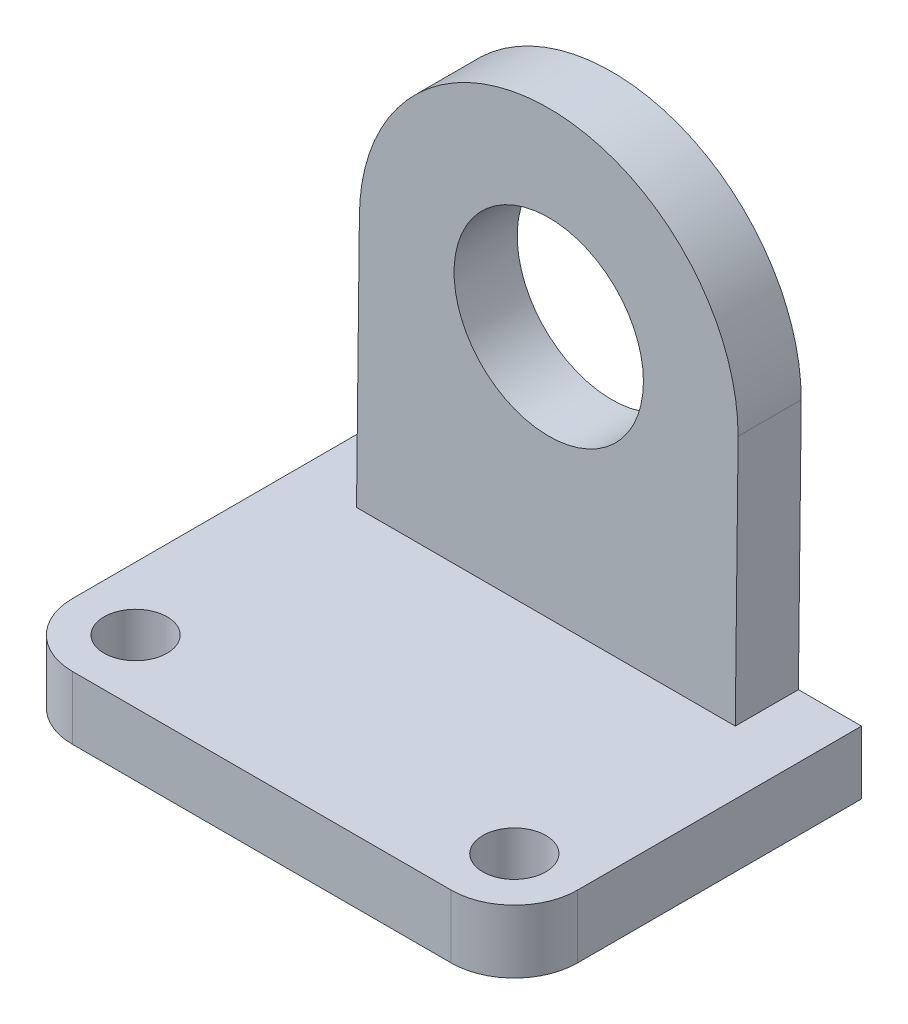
ISO-10303-21;
HEADER;
FILE_DESCRIPTION(('STEP AP214'),'2;1');
FILE_NAME('part.step','',(''),(''),'','','');
FILE_SCHEMA(('AUTOMOTIVE_DESIGN { 1 0 10303 214 1 1 1 1 }'));
ENDSEC;
DATA;
#1=APPLICATION_CONTEXT('core data for automotive mechanical design processes');
#2=APPLICATION_PROTOCOL_DEFINITION('international standard','automotive_design',2000,#1);
#3=PRODUCT_CONTEXT('',#1,'mechanical');
#4=PRODUCT('Part','Part','',(#3));
#5=PRODUCT_RELATED_PRODUCT_CATEGORY('part','',(#4));
#6=PRODUCT_DEFINITION_FORMATION('','',#4);
#7=PRODUCT_DEFINITION_CONTEXT('part definition',#1,'design');
#8=PRODUCT_DEFINITION('design','',#6,#7);
#9=PRODUCT_DEFINITION_SHAPE('','',#8);
#10=(LENGTH_UNIT() NAMED_UNIT(*) SI_UNIT(.MILLI.,.METRE.));
#11=(NAMED_UNIT(*) PLANE_ANGLE_UNIT() SI_UNIT($,.RADIAN.));
#12=(NAMED_UNIT(*) SI_UNIT($,.STERADIAN.) SOLID_ANGLE_UNIT());
#13=UNCERTAINTY_MEASURE_WITH_UNIT(LENGTH_MEASURE(1.E-05),#10,'distance_accuracy_value','');
#14=(GEOMETRIC_REPRESENTATION_CONTEXT(3) GLOBAL_UNCERTAINTY_ASSIGNED_CONTEXT((#13)) GLOBAL_UNIT_ASSIGNED_CONTEXT((#10,
#11,#12)) REPRESENTATION_CONTEXT('',''));
#15=CARTESIAN_POINT('',(0.,0.,0.));
#16=DIRECTION('',(0.,0.,1.));
#17=DIRECTION('',(1.,0.,0.));
#18=AXIS2_PLACEMENT_3D('',#15,#16,#17);
#19=CARTESIAN_POINT('',(-30.,10.,45.));
#20=DIRECTION('',(0.,-1.,0.));
#21=DIRECTION('',(0.,0.,-1.));
#22=AXIS2_PLACEMENT_3D('',#19,#20,#21);
#23=PLANE('',#22);
#24=CARTESIAN_POINT('',(30.,10.,45.));
#25=DIRECTION('',(0.,1.,0.));
#26=DIRECTION('',(0.,0.,-1.));
#27=AXIS2_PLACEMENT_3D('',#24,#25,#26);
#28=CIRCLE('',#27,5.);
#29=CARTESIAN_POINT('',(30.,10.,40.));
#30=VERTEX_POINT('',#29);
#31=EDGE_CURVE('E164',#30,#30,#28,.T.);
#32=ORIENTED_EDGE('',*,*,#31,.F.);
#33=EDGE_LOOP('',(#32));
#34=FACE_BOUND('',#33,.T.);
#35=CARTESIAN_POINT('',(-30.,10.,45.));
#36=DIRECTION('',(0.,1.,0.));
#37=DIRECTION('',(0.,0.,1.));
#38=AXIS2_PLACEMENT_3D('',#35,#36,#37);
#39=CIRCLE('',#38,5.);
#40=CARTESIAN_POINT('',(-30.,10.,50.));
#41=VERTEX_POINT('',#40);
#42=EDGE_CURVE('E154',#41,#41,#39,.T.);
#43=ORIENTED_EDGE('',*,*,#42,.F.);
#44=EDGE_LOOP('',(#43));
#45=FACE_BOUND('',#44,.T.);
#46=DIRECTION('',(0.,0.,-1.));
#47=VECTOR('',#46,1.);
#48=CARTESIAN_POINT('',(29.9999999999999,10.,10.));
#49=LINE('',#48,#47);
#50=CARTESIAN_POINT('',(29.9999999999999,10.,10.));
#51=VERTEX_POINT('',#50);
#52=CARTESIAN_POINT('',(29.9999999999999,10.,0.));
#53=VERTEX_POINT('',#52);
#54=EDGE_CURVE('E189',#51,#53,#49,.T.);
#55=ORIENTED_EDGE('',*,*,#54,.F.);
#56=DIRECTION('',(1.,0.,0.));
#57=VECTOR('',#56,1.);
#58=CARTESIAN_POINT('',(-29.9999999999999,10.,10.));
#59=LINE('',#58,#57);
#60=CARTESIAN_POINT('',(-29.9999999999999,10.,10.));
#61=VERTEX_POINT('',#60);
#62=EDGE_CURVE('E212',#61,#51,#59,.T.);
#63=ORIENTED_EDGE('',*,*,#62,.F.);
#64=DIRECTION('',(0.,0.,-1.));
#65=VECTOR('',#64,1.);
#66=CARTESIAN_POINT('',(-29.9999999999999,10.,10.));
#67=LINE('',#66,#65);
#68=CARTESIAN_POINT('',(-29.9999999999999,10.,0.));
#69=VERTEX_POINT('',#68);
#70=EDGE_CURVE('E210',#61,#69,#67,.T.);
#71=ORIENTED_EDGE('',*,*,#70,.T.);
#72=DIRECTION('',(-1.,0.,0.));
#73=VECTOR('',#72,1.);
#74=CARTESIAN_POINT('',(40.,10.,0.));
#75=LINE('',#74,#73);
#76=CARTESIAN_POINT('',(-40.,10.,0.));
#77=VERTEX_POINT('',#76);
#78=EDGE_CURVE('E56',#69,#77,#75,.T.);
#79=ORIENTED_EDGE('',*,*,#78,.T.);
#80=DIRECTION('',(0.,0.,1.));
#81=VECTOR('',#80,1.);
#82=CARTESIAN_POINT('',(-40.,10.,0.));
#83=LINE('',#82,#81);
#84=CARTESIAN_POINT('',(-40.,10.,45.));
#85=VERTEX_POINT('',#84);
#86=EDGE_CURVE('E147',#77,#85,#83,.T.);
#87=ORIENTED_EDGE('',*,*,#86,.T.);
#88=CARTESIAN_POINT('',(-30.,10.,45.));
#89=DIRECTION('',(0.,1.,0.));
#90=DIRECTION('',(0.,0.,-1.));
#91=AXIS2_PLACEMENT_3D('',#88,#89,#90);
#92=CIRCLE('',#91,10.);
#93=CARTESIAN_POINT('',(-30.,10.,55.));
#94=VERTEX_POINT('',#93);
#95=EDGE_CURVE('E92',#85,#94,#92,.T.);
#96=ORIENTED_EDGE('',*,*,#95,.T.);
#97=DIRECTION('',(1.,0.,0.));
#98=VECTOR('',#97,1.);
#99=CARTESIAN_POINT('',(-30.,10.,55.));
#100=LINE('',#99,#98);
#101=CARTESIAN_POINT('',(30.,10.,55.));
#102=VERTEX_POINT('',#101);
#103=EDGE_CURVE('E110',#94,#102,#100,.T.);
#104=ORIENTED_EDGE('',*,*,#103,.T.);
#105=CARTESIAN_POINT('',(30.,10.,45.));
#106=DIRECTION('',(0.,1.,0.));
#107=DIRECTION('',(0.,0.,1.));
#108=AXIS2_PLACEMENT_3D('',#105,#106,#107);
#109=CIRCLE('',#108,10.);
#110=CARTESIAN_POINT('',(40.,10.,45.));
#111=VERTEX_POINT('',#110);
#112=EDGE_CURVE('E102',#102,#111,#109,.T.);
#113=ORIENTED_EDGE('',*,*,#112,.T.);
#114=DIRECTION('',(0.,0.,-1.));
#115=VECTOR('',#114,1.);
#116=CARTESIAN_POINT('',(40.,10.,0.));
#117=LINE('',#116,#115);
#118=CARTESIAN_POINT('',(40.,10.,0.));
#119=VERTEX_POINT('',#118);
#120=EDGE_CURVE('E107',#111,#119,#117,.T.);
#121=ORIENTED_EDGE('',*,*,#120,.T.);
#122=EDGE_CURVE('E128',#119,#53,#75,.T.);
#123=ORIENTED_EDGE('',*,*,#122,.T.);
#124=EDGE_LOOP('',(#55,#63,#71,#79,#87,#96,#104,#113,#121,#123));
#125=FACE_BOUND('',#124,.T.);
#126=ADVANCED_FACE('F31',(#34,#45,#125),#23,.F.);
#127=CARTESIAN_POINT('',(-30.,0.,45.));
#128=DIRECTION('',(0.,-1.,0.));
#129=DIRECTION('',(0.,0.,-1.));
#130=AXIS2_PLACEMENT_3D('',#127,#128,#129);
#131=PLANE('',#130);
#132=CARTESIAN_POINT('',(-30.,0.,45.));
#133=DIRECTION('',(0.,1.,0.));
#134=DIRECTION('',(0.,0.,1.));
#135=AXIS2_PLACEMENT_3D('',#132,#133,#134);
#136=CIRCLE('',#135,5.);
#137=CARTESIAN_POINT('',(-30.,0.,50.));
#138=VERTEX_POINT('',#137);
#139=EDGE_CURVE('E159',#138,#138,#136,.T.);
#140=ORIENTED_EDGE('',*,*,#139,.T.);
#141=EDGE_LOOP('',(#140));
#142=FACE_BOUND('',#141,.T.);
#143=DIRECTION('',(0.,0.,1.));
#144=VECTOR('',#143,1.);
#145=CARTESIAN_POINT('',(-40.,0.,0.));
#146=LINE('',#145,#144);
#147=CARTESIAN_POINT('',(-40.,0.,0.));
#148=VERTEX_POINT('',#147);
#149=CARTESIAN_POINT('',(-40.,0.,45.));
#150=VERTEX_POINT('',#149);
#151=EDGE_CURVE('E134',#148,#150,#146,.T.);
#152=ORIENTED_EDGE('',*,*,#151,.F.);
#153=DIRECTION('',(-1.,0.,0.));
#154=VECTOR('',#153,1.);
#155=CARTESIAN_POINT('',(40.,0.,0.));
#156=LINE('',#155,#154);
#157=CARTESIAN_POINT('',(40.,0.,0.));
#158=VERTEX_POINT('',#157);
#159=EDGE_CURVE('E84',#158,#148,#156,.T.);
#160=ORIENTED_EDGE('',*,*,#159,.F.);
#161=DIRECTION('',(0.,0.,-1.));
#162=VECTOR('',#161,1.);
#163=CARTESIAN_POINT('',(40.,0.,0.));
#164=LINE('',#163,#162);
#165=CARTESIAN_POINT('',(40.,0.,45.));
#166=VERTEX_POINT('',#165);
#167=EDGE_CURVE('E148',#166,#158,#164,.T.);
#168=ORIENTED_EDGE('',*,*,#167,.F.);
#169=CARTESIAN_POINT('',(30.,0.,45.));
#170=DIRECTION('',(0.,1.,0.));
#171=DIRECTION('',(0.,0.,1.));
#172=AXIS2_PLACEMENT_3D('',#169,#170,#171);
#173=CIRCLE('',#172,10.);
#174=CARTESIAN_POINT('',(30.,0.,55.));
#175=VERTEX_POINT('',#174);
#176=EDGE_CURVE('E119',#175,#166,#173,.T.);
#177=ORIENTED_EDGE('',*,*,#176,.F.);
#178=DIRECTION('',(1.,0.,0.));
#179=VECTOR('',#178,1.);
#180=CARTESIAN_POINT('',(-30.,0.,55.));
#181=LINE('',#180,#179);
#182=CARTESIAN_POINT('',(-30.,0.,55.));
#183=VERTEX_POINT('',#182);
#184=EDGE_CURVE('E151',#183,#175,#181,.T.);
#185=ORIENTED_EDGE('',*,*,#184,.F.);
#186=CARTESIAN_POINT('',(-30.,0.,45.));
#187=DIRECTION('',(0.,1.,0.));
#188=DIRECTION('',(0.,0.,-1.));
#189=AXIS2_PLACEMENT_3D('',#186,#187,#188);
#190=CIRCLE('',#189,10.);
#191=EDGE_CURVE('E152',#150,#183,#190,.T.);
#192=ORIENTED_EDGE('',*,*,#191,.F.);
#193=EDGE_LOOP('',(#152,#160,#168,#177,#185,#192));
#194=FACE_BOUND('',#193,.T.);
#195=CARTESIAN_POINT('',(30.,0.,45.));
#196=DIRECTION('',(0.,1.,0.));
#197=DIRECTION('',(0.,0.,-1.));
#198=AXIS2_PLACEMENT_3D('',#195,#196,#197);
#199=CIRCLE('',#198,5.);
#200=CARTESIAN_POINT('',(30.,0.,40.));
#201=VERTEX_POINT('',#200);
#202=EDGE_CURVE('E167',#201,#201,#199,.T.);
#203=ORIENTED_EDGE('',*,*,#202,.T.);
#204=EDGE_LOOP('',(#203));
#205=FACE_BOUND('',#204,.T.);
#206=ADVANCED_FACE('F177',(#142,#194,#205),#131,.T.);
#207=CARTESIAN_POINT('',(-40.,10.,0.));
#208=DIRECTION('',(1.,0.,0.));
#209=DIRECTION('',(0.,0.,-1.));
#210=AXIS2_PLACEMENT_3D('',#207,#208,#209);
#211=PLANE('',#210);
#212=ORIENTED_EDGE('',*,*,#151,.T.);
#213=DIRECTION('',(0.,-1.,0.));
#214=VECTOR('',#213,1.);
#215=CARTESIAN_POINT('',(-40.,10.,45.));
#216=LINE('',#215,#214);
#217=EDGE_CURVE('E11',#85,#150,#216,.T.);
#218=ORIENTED_EDGE('',*,*,#217,.F.);
#219=ORIENTED_EDGE('',*,*,#86,.F.);
#220=DIRECTION('',(0.,-1.,0.));
#221=VECTOR('',#220,1.);
#222=CARTESIAN_POINT('',(-40.,10.,0.));
#223=LINE('',#222,#221);
#224=EDGE_CURVE('E139',#77,#148,#223,.T.);
#225=ORIENTED_EDGE('',*,*,#224,.T.);
#226=EDGE_LOOP('',(#212,#218,#219,#225));
#227=FACE_BOUND('',#226,.T.);
#228=ADVANCED_FACE('F33',(#227),#211,.F.);
#229=CARTESIAN_POINT('',(-30.,10.,45.));
#230=DIRECTION('',(0.,-1.,0.));
#231=DIRECTION('',(0.,0.,-1.));
#232=AXIS2_PLACEMENT_3D('',#229,#230,#231);
#233=CYLINDRICAL_SURFACE('',#232,10.);
#234=ORIENTED_EDGE('',*,*,#191,.T.);
#235=DIRECTION('',(0.,-1.,0.));
#236=VECTOR('',#235,1.);
#237=CARTESIAN_POINT('',(-30.,10.,55.));
#238=LINE('',#237,#236);
#239=EDGE_CURVE('E40',#94,#183,#238,.T.);
#240=ORIENTED_EDGE('',*,*,#239,.F.);
#241=ORIENTED_EDGE('',*,*,#95,.F.);
#242=ORIENTED_EDGE('',*,*,#217,.T.);
#243=EDGE_LOOP('',(#234,#240,#241,#242));
#244=FACE_BOUND('',#243,.T.);
#245=ADVANCED_FACE('F172',(#244),#233,.T.);
#246=CARTESIAN_POINT('',(-30.,10.,55.));
#247=DIRECTION('',(0.,0.,-1.));
#248=DIRECTION('',(-1.,0.,0.));
#249=AXIS2_PLACEMENT_3D('',#246,#247,#248);
#250=PLANE('',#249);
#251=ORIENTED_EDGE('',*,*,#184,.T.);
#252=DIRECTION('',(0.,-1.,0.));
#253=VECTOR('',#252,1.);
#254=CARTESIAN_POINT('',(30.,10.,55.));
#255=LINE('',#254,#253);
#256=EDGE_CURVE('E122',#102,#175,#255,.T.);
#257=ORIENTED_EDGE('',*,*,#256,.F.);
#258=ORIENTED_EDGE('',*,*,#103,.F.);
#259=ORIENTED_EDGE('',*,*,#239,.T.);
#260=EDGE_LOOP('',(#251,#257,#258,#259));
#261=FACE_BOUND('',#260,.T.);
#262=ADVANCED_FACE('F175',(#261),#250,.F.);
#263=CARTESIAN_POINT('',(30.,10.,45.));
#264=DIRECTION('',(0.,-1.,0.));
#265=DIRECTION('',(0.,0.,-1.));
#266=AXIS2_PLACEMENT_3D('',#263,#264,#265);
#267=CYLINDRICAL_SURFACE('',#266,10.);
#268=ORIENTED_EDGE('',*,*,#176,.T.);
#269=DIRECTION('',(0.,-1.,0.));
#270=VECTOR('',#269,1.);
#271=CARTESIAN_POINT('',(40.,10.,45.));
#272=LINE('',#271,#270);
#273=EDGE_CURVE('E116',#111,#166,#272,.T.);
#274=ORIENTED_EDGE('',*,*,#273,.F.);
#275=ORIENTED_EDGE('',*,*,#112,.F.);
#276=ORIENTED_EDGE('',*,*,#256,.T.);
#277=EDGE_LOOP('',(#268,#274,#275,#276));
#278=FACE_BOUND('',#277,.T.);
#279=ADVANCED_FACE('F117',(#278),#267,.T.);
#280=CARTESIAN_POINT('',(40.,10.,0.));
#281=DIRECTION('',(-1.,0.,0.));
#282=DIRECTION('',(0.,0.,1.));
#283=AXIS2_PLACEMENT_3D('',#280,#281,#282);
#284=PLANE('',#283);
#285=ORIENTED_EDGE('',*,*,#167,.T.);
#286=DIRECTION('',(0.,-1.,0.));
#287=VECTOR('',#286,1.);
#288=CARTESIAN_POINT('',(40.,10.,0.));
#289=LINE('',#288,#287);
#290=EDGE_CURVE('E123',#119,#158,#289,.T.);
#291=ORIENTED_EDGE('',*,*,#290,.F.);
#292=ORIENTED_EDGE('',*,*,#120,.F.);
#293=ORIENTED_EDGE('',*,*,#273,.T.);
#294=EDGE_LOOP('',(#285,#291,#292,#293));
#295=FACE_BOUND('',#294,.T.);
#296=ADVANCED_FACE('F125',(#295),#284,.F.);
#297=CARTESIAN_POINT('',(40.,10.,0.));
#298=DIRECTION('',(0.,0.,1.));
#299=DIRECTION('',(1.,0.,0.));
#300=AXIS2_PLACEMENT_3D('',#297,#298,#299);
#301=PLANE('',#300);
#302=ORIENTED_EDGE('',*,*,#159,.T.);
#303=ORIENTED_EDGE('',*,*,#224,.F.);
#304=ORIENTED_EDGE('',*,*,#78,.F.);
#305=DIRECTION('',(-0.0113095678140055,-0.999936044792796,0.));
#306=VECTOR('',#305,1.);
#307=CARTESIAN_POINT('',(-29.5475883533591,50.,0.));
#308=LINE('',#307,#306);
#309=CARTESIAN_POINT('',(-29.5475883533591,50.,0.));
#310=VERTEX_POINT('',#309);
#311=EDGE_CURVE('E48',#310,#69,#308,.T.);
#312=ORIENTED_EDGE('',*,*,#311,.F.);
#313=CARTESIAN_POINT('',(0.452411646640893,50.,0.));
#314=DIRECTION('',(0.,0.,1.));
#315=DIRECTION('',(-1.,0.,0.));
#316=AXIS2_PLACEMENT_3D('',#313,#314,#315);
#317=CIRCLE('',#316,30.);
#318=CARTESIAN_POINT('',(30.4524116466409,50.,0.));
#319=VERTEX_POINT('',#318);
#320=EDGE_CURVE('E224',#319,#310,#317,.T.);
#321=ORIENTED_EDGE('',*,*,#320,.F.);
#322=DIRECTION('',(0.011309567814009,0.999936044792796,0.));
#323=VECTOR('',#322,1.);
#324=CARTESIAN_POINT('',(29.9999999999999,10.,0.));
#325=LINE('',#324,#323);
#326=EDGE_CURVE('E185',#53,#319,#325,.T.);
#327=ORIENTED_EDGE('',*,*,#326,.F.);
#328=ORIENTED_EDGE('',*,*,#122,.F.);
#329=ORIENTED_EDGE('',*,*,#290,.T.);
#330=EDGE_LOOP('',(#302,#303,#304,#312,#321,#327,#328,#329));
#331=FACE_BOUND('',#330,.T.);
#332=CARTESIAN_POINT('',(0.452411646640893,50.,0.));
#333=DIRECTION('',(0.,0.,1.));
#334=DIRECTION('',(1.,0.,0.));
#335=AXIS2_PLACEMENT_3D('',#332,#333,#334);
#336=CIRCLE('',#335,15.);
#337=CARTESIAN_POINT('',(15.4524116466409,50.,0.));
#338=VERTEX_POINT('',#337);
#339=EDGE_CURVE('E364',#338,#338,#336,.T.);
#340=ORIENTED_EDGE('',*,*,#339,.T.);
#341=EDGE_LOOP('',(#340));
#342=FACE_BOUND('',#341,.T.);
#343=ADVANCED_FACE('F179',(#331,#342),#301,.F.);
#344=CARTESIAN_POINT('',(-30.,10.,45.));
#345=DIRECTION('',(0.,-1.,0.));
#346=DIRECTION('',(0.,0.,-1.));
#347=AXIS2_PLACEMENT_3D('',#344,#345,#346);
#348=CYLINDRICAL_SURFACE('',#347,5.);
#349=ORIENTED_EDGE('',*,*,#42,.T.);
#350=EDGE_LOOP('',(#349));
#351=FACE_BOUND('',#350,.T.);
#352=ORIENTED_EDGE('',*,*,#139,.F.);
#353=EDGE_LOOP('',(#352));
#354=FACE_BOUND('',#353,.T.);
#355=ADVANCED_FACE('F245',(#351,#354),#348,.F.);
#356=CARTESIAN_POINT('',(30.,10.,45.));
#357=DIRECTION('',(0.,-1.,0.));
#358=DIRECTION('',(0.,0.,-1.));
#359=AXIS2_PLACEMENT_3D('',#356,#357,#358);
#360=CYLINDRICAL_SURFACE('',#359,5.);
#361=ORIENTED_EDGE('',*,*,#31,.T.);
#362=EDGE_LOOP('',(#361));
#363=FACE_BOUND('',#362,.T.);
#364=ORIENTED_EDGE('',*,*,#202,.F.);
#365=EDGE_LOOP('',(#364));
#366=FACE_BOUND('',#365,.T.);
#367=ADVANCED_FACE('F233',(#363,#366),#360,.F.);
#368=CARTESIAN_POINT('',(0.452411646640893,50.,10.));
#369=DIRECTION('',(0.,0.,-1.));
#370=DIRECTION('',(-1.,0.,0.));
#371=AXIS2_PLACEMENT_3D('',#368,#369,#370);
#372=PLANE('',#371);
#373=CARTESIAN_POINT('',(0.452411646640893,50.,10.));
#374=DIRECTION('',(0.,0.,1.));
#375=DIRECTION('',(-1.,0.,0.));
#376=AXIS2_PLACEMENT_3D('',#373,#374,#375);
#377=CIRCLE('',#376,30.);
#378=CARTESIAN_POINT('',(30.4524116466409,50.,10.));
#379=VERTEX_POINT('',#378);
#380=CARTESIAN_POINT('',(-29.5475883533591,50.,10.));
#381=VERTEX_POINT('',#380);
#382=EDGE_CURVE('E213',#379,#381,#377,.T.);
#383=ORIENTED_EDGE('',*,*,#382,.T.);
#384=DIRECTION('',(-0.0113095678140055,-0.999936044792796,0.));
#385=VECTOR('',#384,1.);
#386=CARTESIAN_POINT('',(-29.5475883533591,50.,10.));
#387=LINE('',#386,#385);
#388=EDGE_CURVE('E204',#381,#61,#387,.T.);
#389=ORIENTED_EDGE('',*,*,#388,.T.);
#390=ORIENTED_EDGE('',*,*,#62,.T.);
#391=DIRECTION('',(0.011309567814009,0.999936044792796,0.));
#392=VECTOR('',#391,1.);
#393=CARTESIAN_POINT('',(29.9999999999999,10.,10.));
#394=LINE('',#393,#392);
#395=EDGE_CURVE('E218',#51,#379,#394,.T.);
#396=ORIENTED_EDGE('',*,*,#395,.T.);
#397=EDGE_LOOP('',(#383,#389,#390,#396));
#398=FACE_BOUND('',#397,.T.);
#399=CARTESIAN_POINT('',(0.452411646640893,50.,10.));
#400=DIRECTION('',(0.,0.,1.));
#401=DIRECTION('',(1.,0.,0.));
#402=AXIS2_PLACEMENT_3D('',#399,#400,#401);
#403=CIRCLE('',#402,15.);
#404=CARTESIAN_POINT('',(15.4524116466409,50.,10.));
#405=VERTEX_POINT('',#404);
#406=EDGE_CURVE('E361',#405,#405,#403,.T.);
#407=ORIENTED_EDGE('',*,*,#406,.F.);
#408=EDGE_LOOP('',(#407));
#409=FACE_BOUND('',#408,.T.);
#410=ADVANCED_FACE('F216',(#398,#409),#372,.F.);
#411=CARTESIAN_POINT('',(0.452411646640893,50.,10.));
#412=DIRECTION('',(0.,0.,-1.));
#413=DIRECTION('',(-1.,0.,0.));
#414=AXIS2_PLACEMENT_3D('',#411,#412,#413);
#415=CYLINDRICAL_SURFACE('',#414,30.);
#416=ORIENTED_EDGE('',*,*,#320,.T.);
#417=DIRECTION('',(0.,0.,-1.));
#418=VECTOR('',#417,1.);
#419=CARTESIAN_POINT('',(-29.5475883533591,50.,10.));
#420=LINE('',#419,#418);
#421=EDGE_CURVE('E208',#381,#310,#420,.T.);
#422=ORIENTED_EDGE('',*,*,#421,.F.);
#423=ORIENTED_EDGE('',*,*,#382,.F.);
#424=DIRECTION('',(0.,0.,-1.));
#425=VECTOR('',#424,1.);
#426=CARTESIAN_POINT('',(30.4524116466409,50.,10.));
#427=LINE('',#426,#425);
#428=EDGE_CURVE('E370',#379,#319,#427,.T.);
#429=ORIENTED_EDGE('',*,*,#428,.T.);
#430=EDGE_LOOP('',(#416,#422,#423,#429));
#431=FACE_BOUND('',#430,.T.);
#432=ADVANCED_FACE('F223',(#431),#415,.T.);
#433=CARTESIAN_POINT('',(-29.5475883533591,50.,10.));
#434=DIRECTION('',(0.999936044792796,-0.0113095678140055,0.));
#435=DIRECTION('',(0.0113095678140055,0.999936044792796,0.));
#436=AXIS2_PLACEMENT_3D('',#433,#434,#435);
#437=PLANE('',#436);
#438=ORIENTED_EDGE('',*,*,#311,.T.);
#439=ORIENTED_EDGE('',*,*,#70,.F.);
#440=ORIENTED_EDGE('',*,*,#388,.F.);
#441=ORIENTED_EDGE('',*,*,#421,.T.);
#442=EDGE_LOOP('',(#438,#439,#440,#441));
#443=FACE_BOUND('',#442,.T.);
#444=ADVANCED_FACE('F206',(#443),#437,.F.);
#445=CARTESIAN_POINT('',(29.9999999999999,10.,10.));
#446=DIRECTION('',(-0.999936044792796,0.011309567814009,0.));
#447=DIRECTION('',(-0.011309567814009,-0.999936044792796,0.));
#448=AXIS2_PLACEMENT_3D('',#445,#446,#447);
#449=PLANE('',#448);
#450=ORIENTED_EDGE('',*,*,#326,.T.);
#451=ORIENTED_EDGE('',*,*,#428,.F.);
#452=ORIENTED_EDGE('',*,*,#395,.F.);
#453=ORIENTED_EDGE('',*,*,#54,.T.);
#454=EDGE_LOOP('',(#450,#451,#452,#453));
#455=FACE_BOUND('',#454,.T.);
#456=ADVANCED_FACE('F336',(#455),#449,.F.);
#457=CARTESIAN_POINT('',(0.452411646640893,50.,10.));
#458=DIRECTION('',(0.,0.,-1.));
#459=DIRECTION('',(-1.,0.,0.));
#460=AXIS2_PLACEMENT_3D('',#457,#458,#459);
#461=CYLINDRICAL_SURFACE('',#460,15.);
#462=ORIENTED_EDGE('',*,*,#406,.T.);
#463=EDGE_LOOP('',(#462));
#464=FACE_BOUND('',#463,.T.);
#465=ORIENTED_EDGE('',*,*,#339,.F.);
#466=EDGE_LOOP('',(#465));
#467=FACE_BOUND('',#466,.T.);
#468=ADVANCED_FACE('F345',(#464,#467),#461,.F.);
#469=CLOSED_SHELL('',(#126,#206,#228,#245,#262,#279,#296,#343,#355,#367,#410,#432,#444,#456,#468));
#470=MANIFOLD_SOLID_BREP('B2',#469);
#471=ADVANCED_BREP_SHAPE_REPRESENTATION('',(#18,#470),#14);
#472=SHAPE_DEFINITION_REPRESENTATION(#9,#471);
ENDSEC;
END-ISO-10303-21;
